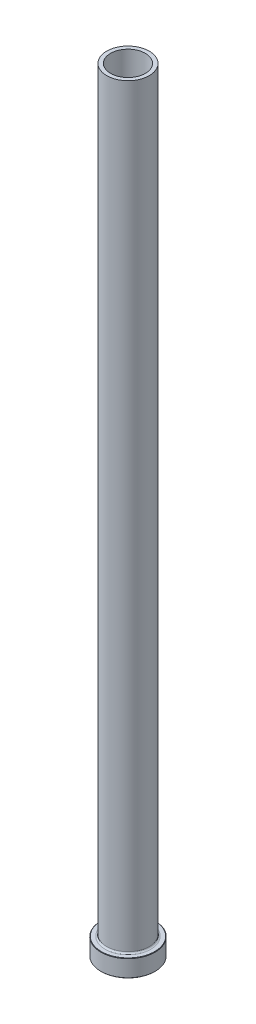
from build123d import *

# Parameters (mm, degrees)
FILLET1_R     = 0.8
CHAMFER1_SIZE = 0.2
CHAMFER3_SIZE = 0.5


with BuildPart() as part:
    # Sketch1 → Revolve1 (revolve)
    with BuildSketch(Plane.XY, mode=Mode.PRIVATE) as revolve1_sk:
        Polygon((-9, 400), (-11, 400), (-11, 9), (-14, 9), (-14, 0), (-9.25, 0), (-9.25, 333), (-9, 345), align=None)
    revolve(revolve1_sk.sketch.rotate(Axis((0, 92.187680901, 0), (0, -1, 0)), 270), axis=Axis((0, 92.187680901, 0), (0, -1, 0)))

    # Fillet1
    fillet1_edges = [part.edges().sort_by_distance(p)[0] for p in [
        (0, 9, -11),
    ]]
    fillet(fillet1_edges, radius=FILLET1_R)

    # Chamfer1
    chamfer1_edges = [part.edges().sort_by_distance(p)[0] for p in [
        (0, 0, -14),
        (0, 9, -14),
    ]]
    chamfer(chamfer1_edges, length=CHAMFER1_SIZE)

    # Chamfer3
    chamfer3_edges = [part.edges().sort_by_distance(p)[0] for p in [
        (0, 0, -9.25),
    ]]
    chamfer(chamfer3_edges, length=CHAMFER3_SIZE)


solid = part.part
